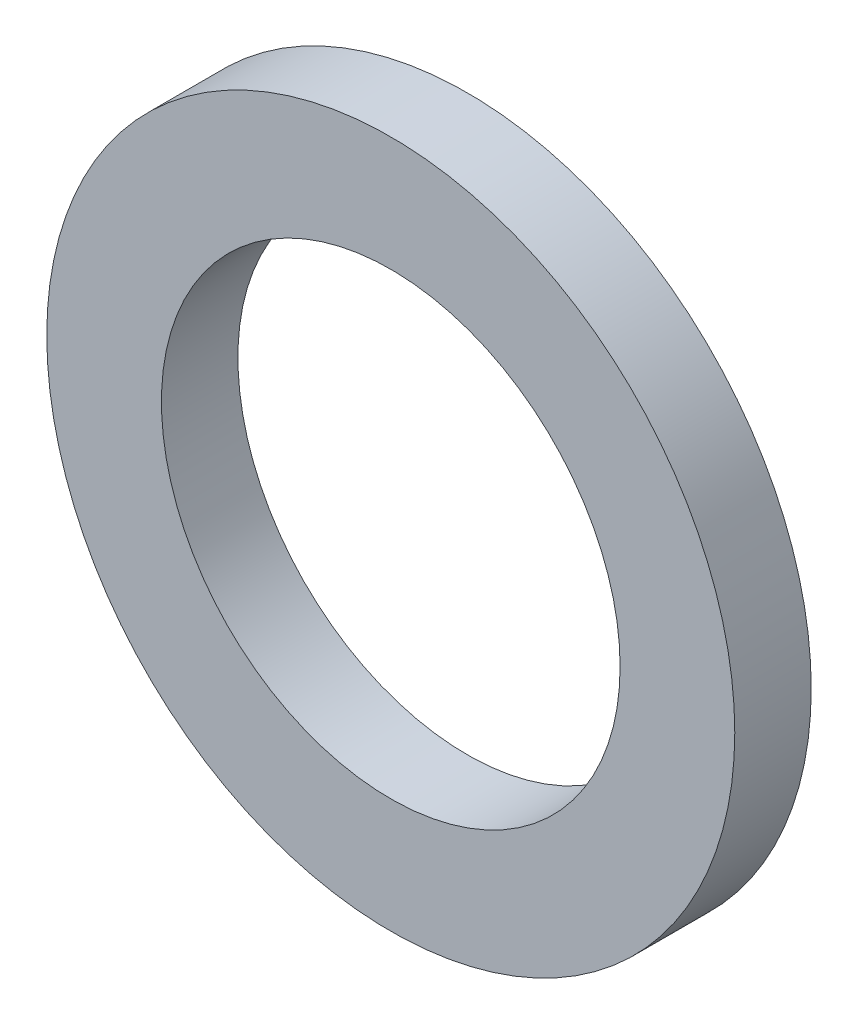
from build123d import *

# Parameters (mm, degrees)
SKETCH_1_R      = 45
SKETCH_1_R_2    = 30
EXTRUDE_1_DEPTH = 10


with BuildPart() as part:
    # Sketch 1 → Extrude 1 (new body)
    with BuildSketch(Plane.XY):
        Circle(SKETCH_1_R)
        Circle(SKETCH_1_R_2, mode=Mode.SUBTRACT)
    extrude(amount=EXTRUDE_1_DEPTH)


solid = part.part
